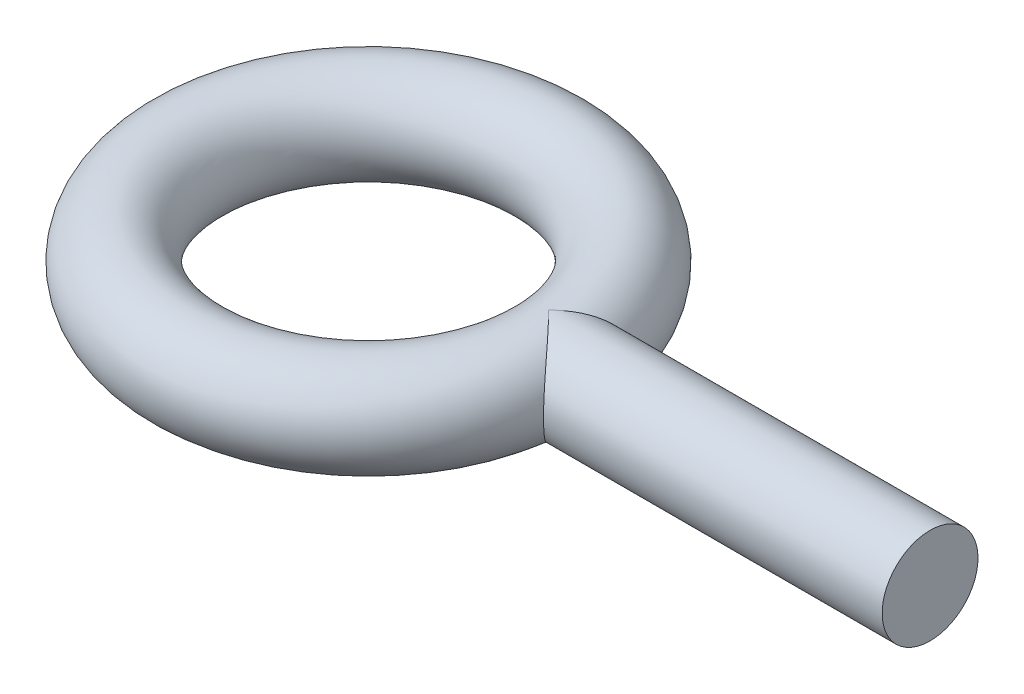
ISO-10303-21;
HEADER;
FILE_DESCRIPTION(('STEP AP214'),'2;1');
FILE_NAME('part.step','',(''),(''),'','','');
FILE_SCHEMA(('AUTOMOTIVE_DESIGN { 1 0 10303 214 1 1 1 1 }'));
ENDSEC;
DATA;
#1=APPLICATION_CONTEXT('core data for automotive mechanical design processes');
#2=APPLICATION_PROTOCOL_DEFINITION('international standard','automotive_design',2000,#1);
#3=PRODUCT_CONTEXT('',#1,'mechanical');
#4=PRODUCT('Part','Part','',(#3));
#5=PRODUCT_RELATED_PRODUCT_CATEGORY('part','',(#4));
#6=PRODUCT_DEFINITION_FORMATION('','',#4);
#7=PRODUCT_DEFINITION_CONTEXT('part definition',#1,'design');
#8=PRODUCT_DEFINITION('design','',#6,#7);
#9=PRODUCT_DEFINITION_SHAPE('','',#8);
#10=(LENGTH_UNIT() NAMED_UNIT(*) SI_UNIT(.MILLI.,.METRE.));
#11=(NAMED_UNIT(*) PLANE_ANGLE_UNIT() SI_UNIT($,.RADIAN.));
#12=(NAMED_UNIT(*) SI_UNIT($,.STERADIAN.) SOLID_ANGLE_UNIT());
#13=UNCERTAINTY_MEASURE_WITH_UNIT(LENGTH_MEASURE(1.E-05),#10,'distance_accuracy_value','');
#14=(GEOMETRIC_REPRESENTATION_CONTEXT(3) GLOBAL_UNCERTAINTY_ASSIGNED_CONTEXT((#13)) GLOBAL_UNIT_ASSIGNED_CONTEXT((#10,
#11,#12)) REPRESENTATION_CONTEXT('',''));
#15=CARTESIAN_POINT('',(0.,0.,0.));
#16=DIRECTION('',(0.,0.,1.));
#17=DIRECTION('',(1.,0.,0.));
#18=AXIS2_PLACEMENT_3D('',#15,#16,#17);
#19=CARTESIAN_POINT('',(37.211,0.,0.));
#20=DIRECTION('',(1.,0.,0.));
#21=DIRECTION('',(0.,0.,-1.));
#22=AXIS2_PLACEMENT_3D('',#19,#20,#21);
#23=PLANE('',#22);
#24=CARTESIAN_POINT('',(37.211,0.,0.));
#25=DIRECTION('',(1.,0.,0.));
#26=DIRECTION('',(0.,0.,-1.));
#27=AXIS2_PLACEMENT_3D('',#24,#25,#26);
#28=CIRCLE('',#27,3.175);
#29=CARTESIAN_POINT('',(37.211,0.,-3.175));
#30=VERTEX_POINT('',#29);
#31=EDGE_CURVE('E11',#30,#30,#28,.T.);
#32=ORIENTED_EDGE('',*,*,#31,.T.);
#33=EDGE_LOOP('',(#32));
#34=FACE_BOUND('',#33,.T.);
#35=ADVANCED_FACE('F39',(#34),#23,.T.);
#36=CARTESIAN_POINT('',(-500000.,0.,0.));
#37=DIRECTION('',(1.,0.,0.));
#38=DIRECTION('',(0.,0.,-1.));
#39=AXIS2_PLACEMENT_3D('',#36,#37,#38);
#40=CYLINDRICAL_SURFACE('',#39,3.175);
#41=ORIENTED_EDGE('',*,*,#31,.F.);
#42=EDGE_LOOP('',(#41));
#43=FACE_BOUND('',#42,.T.);
#44=CARTESIAN_POINT('',(11.9380000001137,-3.175,0.));
#45=CARTESIAN_POINT('',(11.9406561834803,-3.17499999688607,-0.0026561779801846));
#46=CARTESIAN_POINT('',(11.9433119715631,-3.17499666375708,-0.00531285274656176));
#47=CARTESIAN_POINT('',(12.135052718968,-3.17451524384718,-0.197181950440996));
#48=CARTESIAN_POINT('',(12.322108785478,-3.15713518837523,-0.388881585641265));
#49=CARTESIAN_POINT('',(12.6889286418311,-3.08563804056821,-0.773135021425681));
#50=CARTESIAN_POINT('',(12.8686790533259,-3.03145650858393,-0.965689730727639));
#51=CARTESIAN_POINT('',(13.1972415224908,-2.89115679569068,-1.32465345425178));
#52=CARTESIAN_POINT('',(13.347267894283,-2.80927608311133,-1.49158270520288));
#53=CARTESIAN_POINT('',(13.6343563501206,-2.61126456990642,-1.81602054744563));
#54=CARTESIAN_POINT('',(13.7714377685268,-2.49518595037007,-1.97354305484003));
#55=CARTESIAN_POINT('',(14.0000403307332,-2.2559109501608,-2.23970221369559));
#56=CARTESIAN_POINT('',(14.0950172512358,-2.13962377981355,-2.35156349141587));
#57=CARTESIAN_POINT('',(14.2707043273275,-1.88482703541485,-2.56028909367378));
#58=CARTESIAN_POINT('',(14.3514305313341,-1.74634279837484,-2.65717027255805));
#59=CARTESIAN_POINT('',(14.4827521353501,-1.47384984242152,-2.81582722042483));
#60=CARTESIAN_POINT('',(14.5361337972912,-1.34303670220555,-2.88076859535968));
#61=CARTESIAN_POINT('',(14.6281801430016,-1.06921794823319,-2.99320174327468));
#62=CARTESIAN_POINT('',(14.6668515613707,-0.926217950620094,-3.04070150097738));
#63=CARTESIAN_POINT('',(14.7275888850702,-0.630698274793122,-3.11547526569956));
#64=CARTESIAN_POINT('',(14.7495630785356,-0.478130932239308,-3.14263755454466));
#65=CARTESIAN_POINT('',(14.7751575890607,-0.169148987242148,-3.17428643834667));
#66=CARTESIAN_POINT('',(14.7787853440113,-0.0127359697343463,-3.17878222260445));
#67=CARTESIAN_POINT('',(14.768017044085,0.283528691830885,-3.16545785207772));
#68=CARTESIAN_POINT('',(14.7552989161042,0.423543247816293,-3.14971516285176));
#69=CARTESIAN_POINT('',(14.7153581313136,0.698224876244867,-3.10041573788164));
#70=CARTESIAN_POINT('',(14.6881354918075,0.83289195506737,-3.06685902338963));
#71=CARTESIAN_POINT('',(14.6200758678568,1.0952952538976,-2.98331431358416));
#72=CARTESIAN_POINT('',(14.5790725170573,1.22292344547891,-2.93312563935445));
#73=CARTESIAN_POINT('',(14.4852636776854,1.46711957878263,-2.81893212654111));
#74=CARTESIAN_POINT('',(14.4324545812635,1.58368412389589,-2.75492306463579));
#75=CARTESIAN_POINT('',(14.3094123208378,1.81852740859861,-2.60676830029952));
#76=CARTESIAN_POINT('',(14.2378148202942,1.93512093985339,-2.52109452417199));
#77=CARTESIAN_POINT('',(14.084242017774,2.15177711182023,-2.33892238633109));
#78=CARTESIAN_POINT('',(14.0022594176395,2.25182801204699,-2.24241641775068));
#79=CARTESIAN_POINT('',(13.7855458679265,2.48269688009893,-1.9898009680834));
#80=CARTESIAN_POINT('',(13.6453779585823,2.60285902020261,-1.82857214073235));
#81=CARTESIAN_POINT('',(13.3512889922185,2.80726912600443,-1.49603520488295));
#82=CARTESIAN_POINT('',(13.1973369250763,2.89143352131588,-1.32470468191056));
#83=CARTESIAN_POINT('',(12.8651896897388,3.03259103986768,-0.961936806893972));
#84=CARTESIAN_POINT('',(12.6860697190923,3.08634634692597,-0.770106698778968));
#85=CARTESIAN_POINT('',(12.3206168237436,3.15727345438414,-0.387352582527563));
#86=CARTESIAN_POINT('',(12.1342988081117,3.17451713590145,-0.196427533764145));
#87=CARTESIAN_POINT('',(11.943311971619,3.17499666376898,-0.00531285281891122));
#88=CARTESIAN_POINT('',(11.9406561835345,3.17499999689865,-0.0026561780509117));
#89=CARTESIAN_POINT('',(11.9380000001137,3.175,0.));
#90=B_SPLINE_CURVE_WITH_KNOTS('',3,(#44,#45,#46,#47,#48,#49,#50,#51,#52,#53,#54,#55,#56,#57,#58,
#59,#60,#61,#62,#63,#64,#65,#66,#67,#68,#69,#70,#71,#72,#73,#74,#75,#76,#77,#78,#79,#80,#81,#82,
#83,#84,#85,#86,#87,#88,#89),.UNSPECIFIED.,.F.,.F.,(4,2,2,2,2,2,2,2,2,2,2,2,2,2,2,2,2,2,2,2,2,2,
4),(0.,0.0112694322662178,0.813745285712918,1.6176299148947,2.33182783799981,3.04494159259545,
3.60457144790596,4.16356699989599,4.6281359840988,5.09249202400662,5.55938052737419,
6.02607973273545,6.44848544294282,6.87089064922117,7.29859031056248,7.72642085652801,
8.20893503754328,8.6917902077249,9.42308095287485,10.156060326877,10.956914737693,
11.7561910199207,11.7674604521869),.UNSPECIFIED.);
#91=CARTESIAN_POINT('',(11.9380000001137,-3.175,0.));
#92=VERTEX_POINT('',#91);
#93=CARTESIAN_POINT('',(11.9380000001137,3.17500000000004,0.));
#94=VERTEX_POINT('',#93);
#95=EDGE_CURVE('E53',#92,#94,#90,.T.);
#96=ORIENTED_EDGE('',*,*,#95,.T.);
#97=CARTESIAN_POINT('',(11.9380000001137,3.175,0.));
#98=CARTESIAN_POINT('',(11.9406561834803,3.17499999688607,0.0026561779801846));
#99=CARTESIAN_POINT('',(11.9433119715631,3.17499666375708,0.00531285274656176));
#100=CARTESIAN_POINT('',(12.135052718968,3.17451524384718,0.197181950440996));
#101=CARTESIAN_POINT('',(12.322108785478,3.15713518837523,0.388881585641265));
#102=CARTESIAN_POINT('',(12.6889286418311,3.08563804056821,0.773135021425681));
#103=CARTESIAN_POINT('',(12.8686790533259,3.03145650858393,0.965689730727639));
#104=CARTESIAN_POINT('',(13.1972415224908,2.89115679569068,1.32465345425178));
#105=CARTESIAN_POINT('',(13.347267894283,2.80927608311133,1.49158270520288));
#106=CARTESIAN_POINT('',(13.6343563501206,2.61126456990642,1.81602054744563));
#107=CARTESIAN_POINT('',(13.7714377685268,2.49518595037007,1.97354305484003));
#108=CARTESIAN_POINT('',(14.0000403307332,2.2559109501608,2.23970221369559));
#109=CARTESIAN_POINT('',(14.0950172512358,2.13962377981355,2.35156349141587));
#110=CARTESIAN_POINT('',(14.2707043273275,1.88482703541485,2.56028909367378));
#111=CARTESIAN_POINT('',(14.3514305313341,1.74634279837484,2.65717027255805));
#112=CARTESIAN_POINT('',(14.4827521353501,1.47384984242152,2.81582722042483));
#113=CARTESIAN_POINT('',(14.5361337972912,1.34303670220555,2.88076859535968));
#114=CARTESIAN_POINT('',(14.6281801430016,1.06921794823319,2.99320174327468));
#115=CARTESIAN_POINT('',(14.6668515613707,0.926217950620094,3.04070150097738));
#116=CARTESIAN_POINT('',(14.7275888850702,0.630698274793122,3.11547526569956));
#117=CARTESIAN_POINT('',(14.7495630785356,0.478130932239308,3.14263755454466));
#118=CARTESIAN_POINT('',(14.7751575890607,0.169148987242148,3.17428643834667));
#119=CARTESIAN_POINT('',(14.7787853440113,0.0127359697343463,3.17878222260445));
#120=CARTESIAN_POINT('',(14.768017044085,-0.283528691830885,3.16545785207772));
#121=CARTESIAN_POINT('',(14.7552989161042,-0.423543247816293,3.14971516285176));
#122=CARTESIAN_POINT('',(14.7153581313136,-0.698224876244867,3.10041573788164));
#123=CARTESIAN_POINT('',(14.6881354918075,-0.83289195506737,3.06685902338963));
#124=CARTESIAN_POINT('',(14.6200758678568,-1.0952952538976,2.98331431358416));
#125=CARTESIAN_POINT('',(14.5790725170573,-1.22292344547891,2.93312563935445));
#126=CARTESIAN_POINT('',(14.4852636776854,-1.46711957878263,2.81893212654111));
#127=CARTESIAN_POINT('',(14.4324545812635,-1.58368412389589,2.75492306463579));
#128=CARTESIAN_POINT('',(14.3094123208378,-1.81852740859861,2.60676830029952));
#129=CARTESIAN_POINT('',(14.2378148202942,-1.93512093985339,2.52109452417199));
#130=CARTESIAN_POINT('',(14.084242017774,-2.15177711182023,2.33892238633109));
#131=CARTESIAN_POINT('',(14.0022594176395,-2.25182801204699,2.24241641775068));
#132=CARTESIAN_POINT('',(13.7855458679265,-2.48269688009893,1.9898009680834));
#133=CARTESIAN_POINT('',(13.6453779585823,-2.60285902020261,1.82857214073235));
#134=CARTESIAN_POINT('',(13.3512889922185,-2.80726912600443,1.49603520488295));
#135=CARTESIAN_POINT('',(13.1973369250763,-2.89143352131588,1.32470468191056));
#136=CARTESIAN_POINT('',(12.8651896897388,-3.03259103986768,0.961936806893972));
#137=CARTESIAN_POINT('',(12.6860697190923,-3.08634634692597,0.770106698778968));
#138=CARTESIAN_POINT('',(12.3206168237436,-3.15727345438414,0.387352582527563));
#139=CARTESIAN_POINT('',(12.1342988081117,-3.17451713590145,0.196427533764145));
#140=CARTESIAN_POINT('',(11.943311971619,-3.17499666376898,0.00531285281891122));
#141=CARTESIAN_POINT('',(11.9406561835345,-3.17499999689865,0.0026561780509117));
#142=CARTESIAN_POINT('',(11.9380000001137,-3.175,0.));
#143=B_SPLINE_CURVE_WITH_KNOTS('',3,(#97,#98,#99,#100,#101,#102,#103,#104,#105,#106,#107,#108,
#109,#110,#111,#112,#113,#114,#115,#116,#117,#118,#119,#120,#121,#122,#123,#124,#125,#126,#127,
#128,#129,#130,#131,#132,#133,#134,#135,#136,#137,#138,#139,#140,#141,#142),.UNSPECIFIED.,.F.,
.F.,(4,2,2,2,2,2,2,2,2,2,2,2,2,2,2,2,2,2,2,2,2,2,4),(0.,0.0112694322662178,0.813745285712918,
1.6176299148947,2.33182783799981,3.04494159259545,3.60457144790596,4.16356699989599,
4.6281359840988,5.09249202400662,5.55938052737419,6.02607973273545,6.44848544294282,
6.87089064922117,7.29859031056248,7.72642085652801,8.20893503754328,8.6917902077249,
9.42308095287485,10.156060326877,10.956914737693,11.7561910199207,11.7674604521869),.UNSPECIFIED.);
#144=EDGE_CURVE('E43',#94,#92,#143,.T.);
#145=ORIENTED_EDGE('',*,*,#144,.T.);
#146=EDGE_LOOP('',(#96,#145));
#147=FACE_BOUND('',#146,.T.);
#148=ADVANCED_FACE('F61',(#43,#147),#40,.T.);
#149=CARTESIAN_POINT('',(0.,0.,0.));
#150=DIRECTION('',(0.,-1.,0.));
#151=DIRECTION('',(0.,0.,-1.));
#152=AXIS2_PLACEMENT_3D('',#149,#150,#151);
#153=TOROIDAL_SURFACE('',#152,11.938,3.175);
#154=ORIENTED_EDGE('',*,*,#144,.F.);
#155=ORIENTED_EDGE('',*,*,#95,.F.);
#156=EDGE_LOOP('',(#154,#155));
#157=FACE_BOUND('',#156,.T.);
#158=ADVANCED_FACE('F41',(#157),#153,.T.);
#159=CLOSED_SHELL('',(#35,#148,#158));
#160=MANIFOLD_SOLID_BREP('B2',#159);
#161=ADVANCED_BREP_SHAPE_REPRESENTATION('',(#18,#160),#14);
#162=SHAPE_DEFINITION_REPRESENTATION(#9,#161);
ENDSEC;
END-ISO-10303-21;
